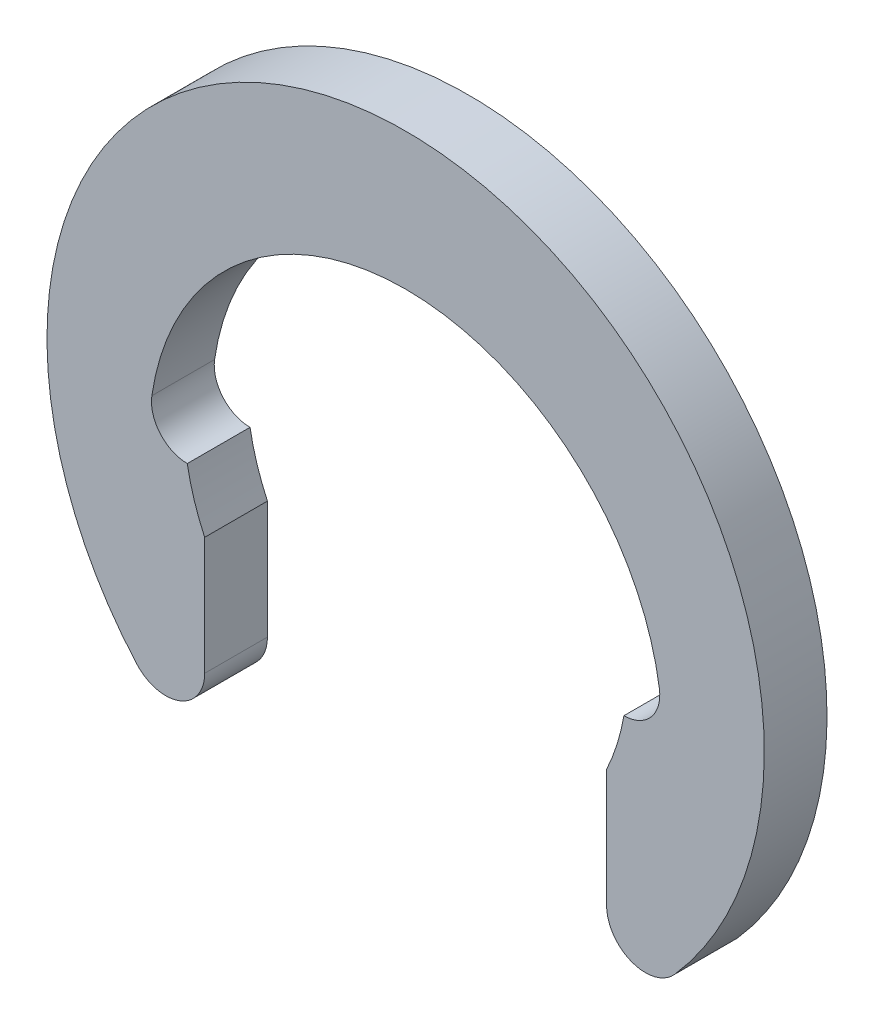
ISO-10303-21;
HEADER;
FILE_DESCRIPTION(('STEP AP214'),'2;1');
FILE_NAME('part.step','',(''),(''),'','','');
FILE_SCHEMA(('AUTOMOTIVE_DESIGN { 1 0 10303 214 1 1 1 1 }'));
ENDSEC;
DATA;
#1=APPLICATION_CONTEXT('core data for automotive mechanical design processes');
#2=APPLICATION_PROTOCOL_DEFINITION('international standard','automotive_design',2000,#1);
#3=PRODUCT_CONTEXT('',#1,'mechanical');
#4=PRODUCT('Part','Part','',(#3));
#5=PRODUCT_RELATED_PRODUCT_CATEGORY('part','',(#4));
#6=PRODUCT_DEFINITION_FORMATION('','',#4);
#7=PRODUCT_DEFINITION_CONTEXT('part definition',#1,'design');
#8=PRODUCT_DEFINITION('design','',#6,#7);
#9=PRODUCT_DEFINITION_SHAPE('','',#8);
#10=(LENGTH_UNIT() NAMED_UNIT(*) SI_UNIT(.MILLI.,.METRE.));
#11=(NAMED_UNIT(*) PLANE_ANGLE_UNIT() SI_UNIT($,.RADIAN.));
#12=(NAMED_UNIT(*) SI_UNIT($,.STERADIAN.) SOLID_ANGLE_UNIT());
#13=UNCERTAINTY_MEASURE_WITH_UNIT(LENGTH_MEASURE(1.E-05),#10,'distance_accuracy_value','');
#14=(GEOMETRIC_REPRESENTATION_CONTEXT(3) GLOBAL_UNCERTAINTY_ASSIGNED_CONTEXT((#13)) GLOBAL_UNIT_ASSIGNED_CONTEXT((#10,
#11,#12)) REPRESENTATION_CONTEXT('',''));
#15=CARTESIAN_POINT('',(0.,0.,0.));
#16=DIRECTION('',(0.,0.,1.));
#17=DIRECTION('',(1.,0.,0.));
#18=AXIS2_PLACEMENT_3D('',#15,#16,#17);
#19=CARTESIAN_POINT('',(0.,0.,-0.381));
#20=DIRECTION('',(0.,0.,1.));
#21=DIRECTION('',(1.,0.,0.));
#22=AXIS2_PLACEMENT_3D('',#19,#20,#21);
#23=CYLINDRICAL_SURFACE('',#22,1.3462);
#24=CARTESIAN_POINT('',(0.,0.,0.));
#25=DIRECTION('',(0.,0.,-1.));
#26=DIRECTION('',(1.,0.,0.));
#27=AXIS2_PLACEMENT_3D('',#24,#25,#26);
#28=CIRCLE('',#27,1.3462);
#29=CARTESIAN_POINT('',(-1.22007154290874,-0.56892870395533,0.));
#30=VERTEX_POINT('',#29);
#31=CARTESIAN_POINT('',(-1.32574819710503,-0.233765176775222,0.));
#32=VERTEX_POINT('',#31);
#33=EDGE_CURVE('E142',#30,#32,#28,.T.);
#34=ORIENTED_EDGE('',*,*,#33,.F.);
#35=DIRECTION('',(0.,0.,1.));
#36=VECTOR('',#35,1.);
#37=CARTESIAN_POINT('',(-1.22007154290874,-0.56892870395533,-0.381));
#38=LINE('',#37,#36);
#39=CARTESIAN_POINT('',(-1.22007154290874,-0.56892870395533,-0.381));
#40=VERTEX_POINT('',#39);
#41=EDGE_CURVE('E11',#40,#30,#38,.T.);
#42=ORIENTED_EDGE('',*,*,#41,.F.);
#43=CARTESIAN_POINT('',(0.,0.,-0.381));
#44=DIRECTION('',(0.,0.,-1.));
#45=DIRECTION('',(1.,0.,0.));
#46=AXIS2_PLACEMENT_3D('',#43,#44,#45);
#47=CIRCLE('',#46,1.3462);
#48=CARTESIAN_POINT('',(-1.32574819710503,-0.233765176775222,-0.381));
#49=VERTEX_POINT('',#48);
#50=EDGE_CURVE('E168',#40,#49,#47,.T.);
#51=ORIENTED_EDGE('',*,*,#50,.T.);
#52=DIRECTION('',(0.,0.,1.));
#53=VECTOR('',#52,1.);
#54=CARTESIAN_POINT('',(-1.32574819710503,-0.233765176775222,-0.381));
#55=LINE('',#54,#53);
#56=EDGE_CURVE('E36',#49,#32,#55,.T.);
#57=ORIENTED_EDGE('',*,*,#56,.T.);
#58=EDGE_LOOP('',(#34,#42,#51,#57));
#59=FACE_BOUND('',#58,.T.);
#60=ADVANCED_FACE('F33',(#59),#23,.F.);
#61=CARTESIAN_POINT('',(-1.22007154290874,-0.56892870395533,-0.381));
#62=DIRECTION('',(1.,0.,0.));
#63=DIRECTION('',(0.,1.,0.));
#64=AXIS2_PLACEMENT_3D('',#61,#62,#63);
#65=PLANE('',#64);
#66=DIRECTION('',(0.,1.,0.));
#67=VECTOR('',#66,1.);
#68=CARTESIAN_POINT('',(-1.22007154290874,-0.56892870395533,0.));
#69=LINE('',#68,#67);
#70=CARTESIAN_POINT('',(-1.22007154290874,-1.28392685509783,0.));
#71=VERTEX_POINT('',#70);
#72=EDGE_CURVE('E166',#71,#30,#69,.T.);
#73=ORIENTED_EDGE('',*,*,#72,.F.);
#74=DIRECTION('',(0.,0.,1.));
#75=VECTOR('',#74,1.);
#76=CARTESIAN_POINT('',(-1.22007154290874,-1.28392685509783,-0.381));
#77=LINE('',#76,#75);
#78=CARTESIAN_POINT('',(-1.22007154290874,-1.28392685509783,-0.381));
#79=VERTEX_POINT('',#78);
#80=EDGE_CURVE('E42',#79,#71,#77,.T.);
#81=ORIENTED_EDGE('',*,*,#80,.F.);
#82=DIRECTION('',(0.,1.,0.));
#83=VECTOR('',#82,1.);
#84=CARTESIAN_POINT('',(-1.22007154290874,-0.56892870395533,-0.381));
#85=LINE('',#84,#83);
#86=EDGE_CURVE('E132',#79,#40,#85,.T.);
#87=ORIENTED_EDGE('',*,*,#86,.T.);
#88=ORIENTED_EDGE('',*,*,#41,.T.);
#89=EDGE_LOOP('',(#73,#81,#87,#88));
#90=FACE_BOUND('',#89,.T.);
#91=ADVANCED_FACE('F184',(#90),#65,.T.);
#92=CARTESIAN_POINT('',(-1.45629154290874,-1.28392685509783,-0.381));
#93=DIRECTION('',(0.,0.,1.));
#94=DIRECTION('',(1.,0.,0.));
#95=AXIS2_PLACEMENT_3D('',#92,#93,#94);
#96=CYLINDRICAL_SURFACE('',#95,0.23622);
#97=CARTESIAN_POINT('',(-1.45629154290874,-1.28392685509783,0.));
#98=DIRECTION('',(0.,0.,1.));
#99=DIRECTION('',(1.,0.,0.));
#100=AXIS2_PLACEMENT_3D('',#97,#98,#99);
#101=CIRCLE('',#100,0.23622);
#102=CARTESIAN_POINT('',(-1.63348077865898,-1.44014421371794,0.));
#103=VERTEX_POINT('',#102);
#104=EDGE_CURVE('E119',#103,#71,#101,.T.);
#105=ORIENTED_EDGE('',*,*,#104,.F.);
#106=DIRECTION('',(0.,0.,1.));
#107=VECTOR('',#106,1.);
#108=CARTESIAN_POINT('',(-1.63348077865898,-1.44014421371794,-0.381));
#109=LINE('',#108,#107);
#110=CARTESIAN_POINT('',(-1.63348077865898,-1.44014421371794,-0.381));
#111=VERTEX_POINT('',#110);
#112=EDGE_CURVE('E114',#111,#103,#109,.T.);
#113=ORIENTED_EDGE('',*,*,#112,.F.);
#114=CARTESIAN_POINT('',(-1.45629154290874,-1.28392685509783,-0.381));
#115=DIRECTION('',(0.,0.,1.));
#116=DIRECTION('',(1.,0.,0.));
#117=AXIS2_PLACEMENT_3D('',#114,#115,#116);
#118=CIRCLE('',#117,0.23622);
#119=EDGE_CURVE('E117',#111,#79,#118,.T.);
#120=ORIENTED_EDGE('',*,*,#119,.T.);
#121=ORIENTED_EDGE('',*,*,#80,.T.);
#122=EDGE_LOOP('',(#105,#113,#120,#121));
#123=FACE_BOUND('',#122,.T.);
#124=ADVANCED_FACE('F116',(#123),#96,.T.);
#125=CARTESIAN_POINT('',(0.,0.,-0.381));
#126=DIRECTION('',(0.,0.,1.));
#127=DIRECTION('',(1.,0.,0.));
#128=AXIS2_PLACEMENT_3D('',#125,#126,#127);
#129=CYLINDRICAL_SURFACE('',#128,2.17767647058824);
#130=CARTESIAN_POINT('',(0.,0.,0.));
#131=DIRECTION('',(0.,0.,1.));
#132=DIRECTION('',(1.,0.,0.));
#133=AXIS2_PLACEMENT_3D('',#130,#131,#132);
#134=CIRCLE('',#133,2.17767647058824);
#135=CARTESIAN_POINT('',(1.63348077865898,-1.44014421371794,0.));
#136=VERTEX_POINT('',#135);
#137=EDGE_CURVE('E163',#136,#103,#134,.T.);
#138=ORIENTED_EDGE('',*,*,#137,.F.);
#139=DIRECTION('',(0.,0.,1.));
#140=VECTOR('',#139,1.);
#141=CARTESIAN_POINT('',(1.63348077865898,-1.44014421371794,-0.381));
#142=LINE('',#141,#140);
#143=CARTESIAN_POINT('',(1.63348077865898,-1.44014421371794,-0.381));
#144=VERTEX_POINT('',#143);
#145=EDGE_CURVE('E124',#144,#136,#142,.T.);
#146=ORIENTED_EDGE('',*,*,#145,.F.);
#147=CARTESIAN_POINT('',(0.,0.,-0.381));
#148=DIRECTION('',(0.,0.,1.));
#149=DIRECTION('',(1.,0.,0.));
#150=AXIS2_PLACEMENT_3D('',#147,#148,#149);
#151=CIRCLE('',#150,2.17767647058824);
#152=EDGE_CURVE('E130',#144,#111,#151,.T.);
#153=ORIENTED_EDGE('',*,*,#152,.T.);
#154=ORIENTED_EDGE('',*,*,#112,.T.);
#155=EDGE_LOOP('',(#138,#146,#153,#154));
#156=FACE_BOUND('',#155,.T.);
#157=ADVANCED_FACE('F134',(#156),#129,.T.);
#158=CARTESIAN_POINT('',(1.45629154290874,-1.28392685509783,-0.381));
#159=DIRECTION('',(0.,0.,1.));
#160=DIRECTION('',(1.,0.,0.));
#161=AXIS2_PLACEMENT_3D('',#158,#159,#160);
#162=CYLINDRICAL_SURFACE('',#161,0.23622);
#163=CARTESIAN_POINT('',(1.45629154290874,-1.28392685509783,0.));
#164=DIRECTION('',(0.,0.,1.));
#165=DIRECTION('',(1.,0.,0.));
#166=AXIS2_PLACEMENT_3D('',#163,#164,#165);
#167=CIRCLE('',#166,0.23622);
#168=CARTESIAN_POINT('',(1.22007154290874,-1.28392685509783,0.));
#169=VERTEX_POINT('',#168);
#170=EDGE_CURVE('E160',#169,#136,#167,.T.);
#171=ORIENTED_EDGE('',*,*,#170,.F.);
#172=DIRECTION('',(0.,0.,1.));
#173=VECTOR('',#172,1.);
#174=CARTESIAN_POINT('',(1.22007154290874,-1.28392685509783,-0.381));
#175=LINE('',#174,#173);
#176=CARTESIAN_POINT('',(1.22007154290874,-1.28392685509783,-0.381));
#177=VERTEX_POINT('',#176);
#178=EDGE_CURVE('E172',#177,#169,#175,.T.);
#179=ORIENTED_EDGE('',*,*,#178,.F.);
#180=CARTESIAN_POINT('',(1.45629154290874,-1.28392685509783,-0.381));
#181=DIRECTION('',(0.,0.,1.));
#182=DIRECTION('',(1.,0.,0.));
#183=AXIS2_PLACEMENT_3D('',#180,#181,#182);
#184=CIRCLE('',#183,0.23622);
#185=EDGE_CURVE('E135',#177,#144,#184,.T.);
#186=ORIENTED_EDGE('',*,*,#185,.T.);
#187=ORIENTED_EDGE('',*,*,#145,.T.);
#188=EDGE_LOOP('',(#171,#179,#186,#187));
#189=FACE_BOUND('',#188,.T.);
#190=ADVANCED_FACE('F197',(#189),#162,.T.);
#191=CARTESIAN_POINT('',(1.22007154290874,-0.56892870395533,-0.381));
#192=DIRECTION('',(-1.,0.,0.));
#193=DIRECTION('',(0.,-1.,0.));
#194=AXIS2_PLACEMENT_3D('',#191,#192,#193);
#195=PLANE('',#194);
#196=DIRECTION('',(0.,-1.,0.));
#197=VECTOR('',#196,1.);
#198=CARTESIAN_POINT('',(1.22007154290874,-0.56892870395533,0.));
#199=LINE('',#198,#197);
#200=CARTESIAN_POINT('',(1.22007154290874,-0.56892870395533,0.));
#201=VERTEX_POINT('',#200);
#202=EDGE_CURVE('E157',#201,#169,#199,.T.);
#203=ORIENTED_EDGE('',*,*,#202,.F.);
#204=DIRECTION('',(0.,0.,1.));
#205=VECTOR('',#204,1.);
#206=CARTESIAN_POINT('',(1.22007154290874,-0.56892870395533,-0.381));
#207=LINE('',#206,#205);
#208=CARTESIAN_POINT('',(1.22007154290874,-0.56892870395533,-0.381));
#209=VERTEX_POINT('',#208);
#210=EDGE_CURVE('E174',#209,#201,#207,.T.);
#211=ORIENTED_EDGE('',*,*,#210,.F.);
#212=DIRECTION('',(0.,-1.,0.));
#213=VECTOR('',#212,1.);
#214=CARTESIAN_POINT('',(1.22007154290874,-0.56892870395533,-0.381));
#215=LINE('',#214,#213);
#216=EDGE_CURVE('E137',#209,#177,#215,.T.);
#217=ORIENTED_EDGE('',*,*,#216,.T.);
#218=ORIENTED_EDGE('',*,*,#178,.T.);
#219=EDGE_LOOP('',(#203,#211,#217,#218));
#220=FACE_BOUND('',#219,.T.);
#221=ADVANCED_FACE('F200',(#220),#195,.T.);
#222=CARTESIAN_POINT('',(0.,0.,-0.381));
#223=DIRECTION('',(0.,0.,1.));
#224=DIRECTION('',(1.,0.,0.));
#225=AXIS2_PLACEMENT_3D('',#222,#223,#224);
#226=CYLINDRICAL_SURFACE('',#225,1.3462);
#227=CARTESIAN_POINT('',(0.,0.,0.));
#228=DIRECTION('',(0.,0.,-1.));
#229=DIRECTION('',(1.,0.,0.));
#230=AXIS2_PLACEMENT_3D('',#227,#228,#229);
#231=CIRCLE('',#230,1.3462);
#232=CARTESIAN_POINT('',(1.32574819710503,-0.233765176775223,0.));
#233=VERTEX_POINT('',#232);
#234=EDGE_CURVE('E154',#233,#201,#231,.T.);
#235=ORIENTED_EDGE('',*,*,#234,.F.);
#236=DIRECTION('',(0.,0.,1.));
#237=VECTOR('',#236,1.);
#238=CARTESIAN_POINT('',(1.32574819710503,-0.233765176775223,-0.381));
#239=LINE('',#238,#237);
#240=CARTESIAN_POINT('',(1.32574819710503,-0.233765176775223,-0.381));
#241=VERTEX_POINT('',#240);
#242=EDGE_CURVE('E176',#241,#233,#239,.T.);
#243=ORIENTED_EDGE('',*,*,#242,.F.);
#244=CARTESIAN_POINT('',(0.,0.,-0.381));
#245=DIRECTION('',(0.,0.,-1.));
#246=DIRECTION('',(1.,0.,0.));
#247=AXIS2_PLACEMENT_3D('',#244,#245,#246);
#248=CIRCLE('',#247,1.3462);
#249=EDGE_CURVE('E299',#241,#209,#248,.T.);
#250=ORIENTED_EDGE('',*,*,#249,.T.);
#251=ORIENTED_EDGE('',*,*,#210,.T.);
#252=EDGE_LOOP('',(#235,#243,#250,#251));
#253=FACE_BOUND('',#252,.T.);
#254=ADVANCED_FACE('F204',(#253),#226,.F.);
#255=CARTESIAN_POINT('',(1.32574819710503,-0.016323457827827,-0.381));
#256=DIRECTION('',(0.,0.,1.));
#257=DIRECTION('',(1.,0.,0.));
#258=AXIS2_PLACEMENT_3D('',#255,#256,#257);
#259=CYLINDRICAL_SURFACE('',#258,0.217441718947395);
#260=CARTESIAN_POINT('',(1.32574819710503,-0.016323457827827,0.));
#261=DIRECTION('',(0.,0.,-1.));
#262=DIRECTION('',(1.,0.,0.));
#263=AXIS2_PLACEMENT_3D('',#260,#261,#262);
#264=CIRCLE('',#263,0.217441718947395);
#265=CARTESIAN_POINT('',(1.5408771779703,0.0153060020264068,0.));
#266=VERTEX_POINT('',#265);
#267=EDGE_CURVE('E151',#266,#233,#264,.T.);
#268=ORIENTED_EDGE('',*,*,#267,.F.);
#269=DIRECTION('',(0.,0.,1.));
#270=VECTOR('',#269,1.);
#271=CARTESIAN_POINT('',(1.5408771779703,0.0153060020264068,-0.381));
#272=LINE('',#271,#270);
#273=CARTESIAN_POINT('',(1.5408771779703,0.0153060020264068,-0.381));
#274=VERTEX_POINT('',#273);
#275=EDGE_CURVE('E178',#274,#266,#272,.T.);
#276=ORIENTED_EDGE('',*,*,#275,.F.);
#277=CARTESIAN_POINT('',(1.32574819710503,-0.016323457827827,-0.381));
#278=DIRECTION('',(0.,0.,-1.));
#279=DIRECTION('',(1.,0.,0.));
#280=AXIS2_PLACEMENT_3D('',#277,#278,#279);
#281=CIRCLE('',#280,0.217441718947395);
#282=EDGE_CURVE('E295',#274,#241,#281,.T.);
#283=ORIENTED_EDGE('',*,*,#282,.T.);
#284=ORIENTED_EDGE('',*,*,#242,.T.);
#285=EDGE_LOOP('',(#268,#276,#283,#284));
#286=FACE_BOUND('',#285,.T.);
#287=ADVANCED_FACE('F208',(#286),#259,.F.);
#288=CARTESIAN_POINT('',(0.,-0.211242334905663,-0.381));
#289=DIRECTION('',(0.,0.,1.));
#290=DIRECTION('',(1.,0.,0.));
#291=AXIS2_PLACEMENT_3D('',#288,#289,#290);
#292=CYLINDRICAL_SURFACE('',#291,1.55744233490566);
#293=CARTESIAN_POINT('',(0.,-0.211242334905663,0.));
#294=DIRECTION('',(0.,0.,-1.));
#295=DIRECTION('',(1.,0.,0.));
#296=AXIS2_PLACEMENT_3D('',#293,#294,#295);
#297=CIRCLE('',#296,1.55744233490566);
#298=CARTESIAN_POINT('',(-1.5408771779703,0.015306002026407,0.));
#299=VERTEX_POINT('',#298);
#300=EDGE_CURVE('E148',#299,#266,#297,.T.);
#301=ORIENTED_EDGE('',*,*,#300,.F.);
#302=DIRECTION('',(0.,0.,1.));
#303=VECTOR('',#302,1.);
#304=CARTESIAN_POINT('',(-1.5408771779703,0.015306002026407,-0.381));
#305=LINE('',#304,#303);
#306=CARTESIAN_POINT('',(-1.5408771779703,0.015306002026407,-0.381));
#307=VERTEX_POINT('',#306);
#308=EDGE_CURVE('E179',#307,#299,#305,.T.);
#309=ORIENTED_EDGE('',*,*,#308,.F.);
#310=CARTESIAN_POINT('',(0.,-0.211242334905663,-0.381));
#311=DIRECTION('',(0.,0.,-1.));
#312=DIRECTION('',(1.,0.,0.));
#313=AXIS2_PLACEMENT_3D('',#310,#311,#312);
#314=CIRCLE('',#313,1.55744233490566);
#315=EDGE_CURVE('E306',#307,#274,#314,.T.);
#316=ORIENTED_EDGE('',*,*,#315,.T.);
#317=ORIENTED_EDGE('',*,*,#275,.T.);
#318=EDGE_LOOP('',(#301,#309,#316,#317));
#319=FACE_BOUND('',#318,.T.);
#320=ADVANCED_FACE('F212',(#319),#292,.F.);
#321=CARTESIAN_POINT('',(-1.32574819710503,-0.016323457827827,-0.381));
#322=DIRECTION('',(0.,0.,1.));
#323=DIRECTION('',(1.,0.,0.));
#324=AXIS2_PLACEMENT_3D('',#321,#322,#323);
#325=CYLINDRICAL_SURFACE('',#324,0.217441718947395);
#326=CARTESIAN_POINT('',(-1.32574819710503,-0.016323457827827,0.));
#327=DIRECTION('',(0.,0.,-1.));
#328=DIRECTION('',(1.,0.,0.));
#329=AXIS2_PLACEMENT_3D('',#326,#327,#328);
#330=CIRCLE('',#329,0.217441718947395);
#331=EDGE_CURVE('E145',#32,#299,#330,.T.);
#332=ORIENTED_EDGE('',*,*,#331,.F.);
#333=ORIENTED_EDGE('',*,*,#56,.F.);
#334=CARTESIAN_POINT('',(-1.32574819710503,-0.016323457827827,-0.381));
#335=DIRECTION('',(0.,0.,-1.));
#336=DIRECTION('',(1.,0.,0.));
#337=AXIS2_PLACEMENT_3D('',#334,#335,#336);
#338=CIRCLE('',#337,0.217441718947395);
#339=EDGE_CURVE('E308',#49,#307,#338,.T.);
#340=ORIENTED_EDGE('',*,*,#339,.T.);
#341=ORIENTED_EDGE('',*,*,#308,.T.);
#342=EDGE_LOOP('',(#332,#333,#340,#341));
#343=FACE_BOUND('',#342,.T.);
#344=ADVANCED_FACE('F181',(#343),#325,.F.);
#345=CARTESIAN_POINT('',(0.,0.,-0.381));
#346=DIRECTION('',(0.,0.,1.));
#347=DIRECTION('',(1.,0.,0.));
#348=AXIS2_PLACEMENT_3D('',#345,#346,#347);
#349=PLANE('',#348);
#350=ORIENTED_EDGE('',*,*,#50,.F.);
#351=ORIENTED_EDGE('',*,*,#86,.F.);
#352=ORIENTED_EDGE('',*,*,#119,.F.);
#353=ORIENTED_EDGE('',*,*,#152,.F.);
#354=ORIENTED_EDGE('',*,*,#185,.F.);
#355=ORIENTED_EDGE('',*,*,#216,.F.);
#356=ORIENTED_EDGE('',*,*,#249,.F.);
#357=ORIENTED_EDGE('',*,*,#282,.F.);
#358=ORIENTED_EDGE('',*,*,#315,.F.);
#359=ORIENTED_EDGE('',*,*,#339,.F.);
#360=EDGE_LOOP('',(#350,#351,#352,#353,#354,#355,#356,#357,#358,#359));
#361=FACE_BOUND('',#360,.T.);
#362=ADVANCED_FACE('F128',(#361),#349,.F.);
#363=CARTESIAN_POINT('',(0.,0.,0.));
#364=DIRECTION('',(0.,0.,1.));
#365=DIRECTION('',(1.,0.,0.));
#366=AXIS2_PLACEMENT_3D('',#363,#364,#365);
#367=PLANE('',#366);
#368=ORIENTED_EDGE('',*,*,#33,.T.);
#369=ORIENTED_EDGE('',*,*,#331,.T.);
#370=ORIENTED_EDGE('',*,*,#300,.T.);
#371=ORIENTED_EDGE('',*,*,#267,.T.);
#372=ORIENTED_EDGE('',*,*,#234,.T.);
#373=ORIENTED_EDGE('',*,*,#202,.T.);
#374=ORIENTED_EDGE('',*,*,#170,.T.);
#375=ORIENTED_EDGE('',*,*,#137,.T.);
#376=ORIENTED_EDGE('',*,*,#104,.T.);
#377=ORIENTED_EDGE('',*,*,#72,.T.);
#378=EDGE_LOOP('',(#368,#369,#370,#371,#372,#373,#374,#375,#376,#377));
#379=FACE_BOUND('',#378,.T.);
#380=ADVANCED_FACE('F183',(#379),#367,.T.);
#381=CLOSED_SHELL('',(#60,#91,#124,#157,#190,#221,#254,#287,#320,#344,#362,#380));
#382=MANIFOLD_SOLID_BREP('B2',#381);
#383=ADVANCED_BREP_SHAPE_REPRESENTATION('',(#18,#382),#14);
#384=SHAPE_DEFINITION_REPRESENTATION(#9,#383);
ENDSEC;
END-ISO-10303-21;
